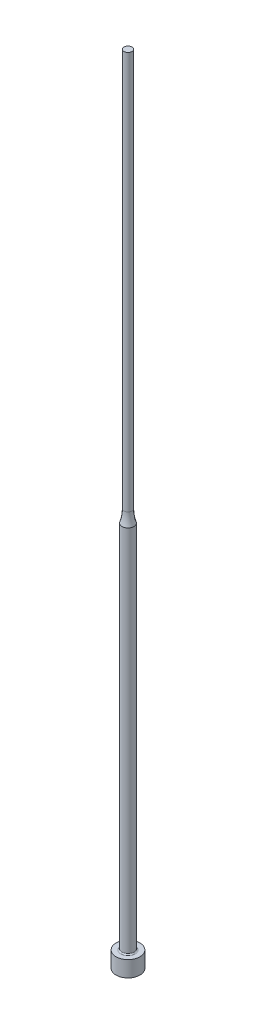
from build123d import *


with BuildPart() as part:
    # Sketch1 → Revolve1 (revolve)
    with BuildSketch(Plane.XY, mode=Mode.PRIVATE) as revolve1_sk:
        with BuildLine():
            Line((0, 0), (3, 0))
            Line((3, 0), (3, 4))
            Line((3, 4), (1.8, 4))
            ThreePointArc((1.8, 4), (1.587867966, 4.087867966), (1.5, 4.3))
            Line((1.5, 4.3), (1.5, 96.877501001))
            ThreePointArc((1.5, 96.877501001), (1.125791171, 98.41886117), (1, 100))
            Line((1, 100), (1, 200))
            Line((1, 200), (0, 200))
            Line((0, 200), (0, 0))
        make_face()
    revolve(revolve1_sk.sketch.rotate(Axis((0, 200, 0), (0, -1, 0)), 180), axis=Axis((0, 200, 0), (0, -1, 0)))


solid = part.part
